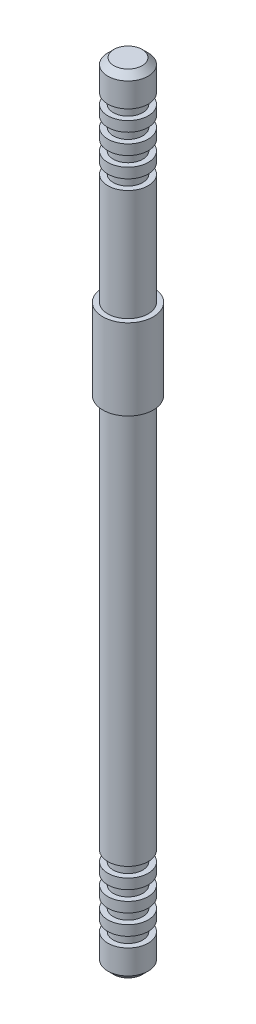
ISO-10303-21;
HEADER;
FILE_DESCRIPTION(('STEP AP214'),'2;1');
FILE_NAME('part.step','',(''),(''),'','','');
FILE_SCHEMA(('AUTOMOTIVE_DESIGN { 1 0 10303 214 1 1 1 1 }'));
ENDSEC;
DATA;
#1=APPLICATION_CONTEXT('core data for automotive mechanical design processes');
#2=APPLICATION_PROTOCOL_DEFINITION('international standard','automotive_design',2000,#1);
#3=PRODUCT_CONTEXT('',#1,'mechanical');
#4=PRODUCT('Part','Part','',(#3));
#5=PRODUCT_RELATED_PRODUCT_CATEGORY('part','',(#4));
#6=PRODUCT_DEFINITION_FORMATION('','',#4);
#7=PRODUCT_DEFINITION_CONTEXT('part definition',#1,'design');
#8=PRODUCT_DEFINITION('design','',#6,#7);
#9=PRODUCT_DEFINITION_SHAPE('','',#8);
#10=(LENGTH_UNIT() NAMED_UNIT(*) SI_UNIT(.MILLI.,.METRE.));
#11=(NAMED_UNIT(*) PLANE_ANGLE_UNIT() SI_UNIT($,.RADIAN.));
#12=(NAMED_UNIT(*) SI_UNIT($,.STERADIAN.) SOLID_ANGLE_UNIT());
#13=UNCERTAINTY_MEASURE_WITH_UNIT(LENGTH_MEASURE(1.E-05),#10,'distance_accuracy_value','');
#14=(GEOMETRIC_REPRESENTATION_CONTEXT(3) GLOBAL_UNCERTAINTY_ASSIGNED_CONTEXT((#13)) GLOBAL_UNIT_ASSIGNED_CONTEXT((#10,
#11,#12)) REPRESENTATION_CONTEXT('',''));
#15=CARTESIAN_POINT('',(0.,0.,0.));
#16=DIRECTION('',(0.,0.,1.));
#17=DIRECTION('',(1.,0.,0.));
#18=AXIS2_PLACEMENT_3D('',#15,#16,#17);
#19=CARTESIAN_POINT('',(-25.3725750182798,-54.7900027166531,0.));
#20=DIRECTION('',(0.,-1.,0.));
#21=DIRECTION('',(0.,0.,-1.));
#22=AXIS2_PLACEMENT_3D('',#19,#20,#21);
#23=PLANE('',#22);
#24=CARTESIAN_POINT('',(-25.3725750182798,-54.7900027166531,0.));
#25=DIRECTION('',(0.,-1.,0.));
#26=DIRECTION('',(0.,0.,-1.));
#27=AXIS2_PLACEMENT_3D('',#24,#25,#26);
#28=CIRCLE('',#27,0.700000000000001);
#29=CARTESIAN_POINT('',(-25.3725750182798,-54.7900027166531,-0.700000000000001));
#30=VERTEX_POINT('',#29);
#31=EDGE_CURVE('E10',#30,#30,#28,.F.);
#32=ORIENTED_EDGE('',*,*,#31,.T.);
#33=EDGE_LOOP('',(#32));
#34=FACE_BOUND('',#33,.T.);
#35=ADVANCED_FACE('F30',(#34),#23,.F.);
#36=CARTESIAN_POINT('',(-25.3725750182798,-54.7900027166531,0.));
#37=DIRECTION('',(0.,-1.,0.));
#38=DIRECTION('',(0.,0.,-1.));
#39=AXIS2_PLACEMENT_3D('',#36,#37,#38);
#40=CYLINDRICAL_SURFACE('',#39,1.);
#41=CARTESIAN_POINT('',(-25.3725750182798,-55.0900027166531,0.));
#42=DIRECTION('',(0.,-1.,0.));
#43=DIRECTION('',(0.,0.,-1.));
#44=AXIS2_PLACEMENT_3D('',#41,#42,#43);
#45=CIRCLE('',#44,1.);
#46=CARTESIAN_POINT('',(-25.3725750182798,-55.0900027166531,-1.));
#47=VERTEX_POINT('',#46);
#48=EDGE_CURVE('E36',#47,#47,#45,.T.);
#49=ORIENTED_EDGE('',*,*,#48,.T.);
#50=EDGE_LOOP('',(#49));
#51=FACE_BOUND('',#50,.T.);
#52=CARTESIAN_POINT('',(-25.3725750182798,-56.2900027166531,0.));
#53=DIRECTION('',(0.,-1.,0.));
#54=DIRECTION('',(0.,0.,-1.));
#55=AXIS2_PLACEMENT_3D('',#52,#53,#54);
#56=CIRCLE('',#55,1.);
#57=CARTESIAN_POINT('',(-25.3725750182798,-56.2900027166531,-1.));
#58=VERTEX_POINT('',#57);
#59=EDGE_CURVE('E49',#58,#58,#56,.T.);
#60=ORIENTED_EDGE('',*,*,#59,.F.);
#61=EDGE_LOOP('',(#60));
#62=FACE_BOUND('',#61,.T.);
#63=ADVANCED_FACE('F367',(#51,#62),#40,.T.);
#64=CARTESIAN_POINT('',(-26.3725750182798,-56.2900027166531,0.));
#65=DIRECTION('',(0.,1.,0.));
#66=DIRECTION('',(0.,0.,1.));
#67=AXIS2_PLACEMENT_3D('',#64,#65,#66);
#68=PLANE('',#67);
#69=CARTESIAN_POINT('',(-25.3725750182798,-56.2900027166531,0.));
#70=DIRECTION('',(0.,-1.,0.));
#71=DIRECTION('',(0.,0.,-1.));
#72=AXIS2_PLACEMENT_3D('',#69,#70,#71);
#73=CIRCLE('',#72,0.730000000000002);
#74=CARTESIAN_POINT('',(-25.3725750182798,-56.2900027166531,-0.730000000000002));
#75=VERTEX_POINT('',#74);
#76=EDGE_CURVE('E52',#75,#75,#73,.T.);
#77=ORIENTED_EDGE('',*,*,#76,.F.);
#78=EDGE_LOOP('',(#77));
#79=FACE_BOUND('',#78,.T.);
#80=ORIENTED_EDGE('',*,*,#59,.T.);
#81=EDGE_LOOP('',(#80));
#82=FACE_BOUND('',#81,.T.);
#83=ADVANCED_FACE('F361',(#79,#82),#68,.F.);
#84=CARTESIAN_POINT('',(-25.3725750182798,-54.7900027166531,0.));
#85=DIRECTION('',(0.,-1.,0.));
#86=DIRECTION('',(0.,0.,-1.));
#87=AXIS2_PLACEMENT_3D('',#84,#85,#86);
#88=CYLINDRICAL_SURFACE('',#87,0.730000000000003);
#89=CARTESIAN_POINT('',(-25.3725750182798,-56.7900027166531,0.));
#90=DIRECTION('',(0.,-1.,0.));
#91=DIRECTION('',(0.,0.,-1.));
#92=AXIS2_PLACEMENT_3D('',#89,#90,#91);
#93=CIRCLE('',#92,0.730000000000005);
#94=CARTESIAN_POINT('',(-25.3725750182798,-56.7900027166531,-0.730000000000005));
#95=VERTEX_POINT('',#94);
#96=EDGE_CURVE('E55',#95,#95,#93,.T.);
#97=ORIENTED_EDGE('',*,*,#96,.F.);
#98=EDGE_LOOP('',(#97));
#99=FACE_BOUND('',#98,.T.);
#100=ORIENTED_EDGE('',*,*,#76,.T.);
#101=EDGE_LOOP('',(#100));
#102=FACE_BOUND('',#101,.T.);
#103=ADVANCED_FACE('F355',(#99,#102),#88,.T.);
#104=CARTESIAN_POINT('',(-26.1025750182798,-56.7900027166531,0.));
#105=DIRECTION('',(0.,-1.,0.));
#106=DIRECTION('',(0.,0.,-1.));
#107=AXIS2_PLACEMENT_3D('',#104,#105,#106);
#108=PLANE('',#107);
#109=CARTESIAN_POINT('',(-25.3725750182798,-56.7900027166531,0.));
#110=DIRECTION('',(0.,-1.,0.));
#111=DIRECTION('',(0.,0.,-1.));
#112=AXIS2_PLACEMENT_3D('',#109,#110,#111);
#113=CIRCLE('',#112,1.);
#114=CARTESIAN_POINT('',(-25.3725750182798,-56.7900027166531,-1.));
#115=VERTEX_POINT('',#114);
#116=EDGE_CURVE('E58',#115,#115,#113,.T.);
#117=ORIENTED_EDGE('',*,*,#116,.F.);
#118=EDGE_LOOP('',(#117));
#119=FACE_BOUND('',#118,.T.);
#120=ORIENTED_EDGE('',*,*,#96,.T.);
#121=EDGE_LOOP('',(#120));
#122=FACE_BOUND('',#121,.T.);
#123=ADVANCED_FACE('F349',(#119,#122),#108,.F.);
#124=CARTESIAN_POINT('',(-25.3725750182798,-54.7900027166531,0.));
#125=DIRECTION('',(0.,-1.,0.));
#126=DIRECTION('',(0.,0.,-1.));
#127=AXIS2_PLACEMENT_3D('',#124,#125,#126);
#128=CYLINDRICAL_SURFACE('',#127,1.);
#129=CARTESIAN_POINT('',(-25.3725750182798,-57.2900027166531,0.));
#130=DIRECTION('',(0.,-1.,0.));
#131=DIRECTION('',(0.,0.,-1.));
#132=AXIS2_PLACEMENT_3D('',#129,#130,#131);
#133=CIRCLE('',#132,1.);
#134=CARTESIAN_POINT('',(-25.3725750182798,-57.2900027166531,-1.));
#135=VERTEX_POINT('',#134);
#136=EDGE_CURVE('E61',#135,#135,#133,.T.);
#137=ORIENTED_EDGE('',*,*,#136,.F.);
#138=EDGE_LOOP('',(#137));
#139=FACE_BOUND('',#138,.T.);
#140=ORIENTED_EDGE('',*,*,#116,.T.);
#141=EDGE_LOOP('',(#140));
#142=FACE_BOUND('',#141,.T.);
#143=ADVANCED_FACE('F343',(#139,#142),#128,.T.);
#144=CARTESIAN_POINT('',(-26.3725750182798,-57.2900027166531,0.));
#145=DIRECTION('',(0.,1.,0.));
#146=DIRECTION('',(0.,0.,1.));
#147=AXIS2_PLACEMENT_3D('',#144,#145,#146);
#148=PLANE('',#147);
#149=CARTESIAN_POINT('',(-25.3725750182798,-57.2900027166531,0.));
#150=DIRECTION('',(0.,-1.,0.));
#151=DIRECTION('',(0.,0.,-1.));
#152=AXIS2_PLACEMENT_3D('',#149,#150,#151);
#153=CIRCLE('',#152,0.730000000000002);
#154=CARTESIAN_POINT('',(-25.3725750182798,-57.2900027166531,-0.730000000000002));
#155=VERTEX_POINT('',#154);
#156=EDGE_CURVE('E64',#155,#155,#153,.T.);
#157=ORIENTED_EDGE('',*,*,#156,.F.);
#158=EDGE_LOOP('',(#157));
#159=FACE_BOUND('',#158,.T.);
#160=ORIENTED_EDGE('',*,*,#136,.T.);
#161=EDGE_LOOP('',(#160));
#162=FACE_BOUND('',#161,.T.);
#163=ADVANCED_FACE('F337',(#159,#162),#148,.F.);
#164=CARTESIAN_POINT('',(-25.3725750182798,-54.7900027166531,0.));
#165=DIRECTION('',(0.,-1.,0.));
#166=DIRECTION('',(0.,0.,-1.));
#167=AXIS2_PLACEMENT_3D('',#164,#165,#166);
#168=CYLINDRICAL_SURFACE('',#167,0.730000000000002);
#169=CARTESIAN_POINT('',(-25.3725750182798,-57.7900027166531,0.));
#170=DIRECTION('',(0.,-1.,0.));
#171=DIRECTION('',(0.,0.,-1.));
#172=AXIS2_PLACEMENT_3D('',#169,#170,#171);
#173=CIRCLE('',#172,0.730000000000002);
#174=CARTESIAN_POINT('',(-25.3725750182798,-57.7900027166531,-0.730000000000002));
#175=VERTEX_POINT('',#174);
#176=EDGE_CURVE('E67',#175,#175,#173,.T.);
#177=ORIENTED_EDGE('',*,*,#176,.F.);
#178=EDGE_LOOP('',(#177));
#179=FACE_BOUND('',#178,.T.);
#180=ORIENTED_EDGE('',*,*,#156,.T.);
#181=EDGE_LOOP('',(#180));
#182=FACE_BOUND('',#181,.T.);
#183=ADVANCED_FACE('F331',(#179,#182),#168,.T.);
#184=CARTESIAN_POINT('',(-26.1025750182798,-57.7900027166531,0.));
#185=DIRECTION('',(0.,-1.,0.));
#186=DIRECTION('',(0.,0.,-1.));
#187=AXIS2_PLACEMENT_3D('',#184,#185,#186);
#188=PLANE('',#187);
#189=CARTESIAN_POINT('',(-25.3725750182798,-57.7900027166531,0.));
#190=DIRECTION('',(0.,-1.,0.));
#191=DIRECTION('',(0.,0.,-1.));
#192=AXIS2_PLACEMENT_3D('',#189,#190,#191);
#193=CIRCLE('',#192,1.);
#194=CARTESIAN_POINT('',(-25.3725750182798,-57.7900027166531,-1.));
#195=VERTEX_POINT('',#194);
#196=EDGE_CURVE('E70',#195,#195,#193,.T.);
#197=ORIENTED_EDGE('',*,*,#196,.F.);
#198=EDGE_LOOP('',(#197));
#199=FACE_BOUND('',#198,.T.);
#200=ORIENTED_EDGE('',*,*,#176,.T.);
#201=EDGE_LOOP('',(#200));
#202=FACE_BOUND('',#201,.T.);
#203=ADVANCED_FACE('F325',(#199,#202),#188,.F.);
#204=CARTESIAN_POINT('',(-25.3725750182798,-54.7900027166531,0.));
#205=DIRECTION('',(0.,-1.,0.));
#206=DIRECTION('',(0.,0.,-1.));
#207=AXIS2_PLACEMENT_3D('',#204,#205,#206);
#208=CYLINDRICAL_SURFACE('',#207,1.);
#209=CARTESIAN_POINT('',(-25.3725750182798,-58.2900027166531,0.));
#210=DIRECTION('',(0.,-1.,0.));
#211=DIRECTION('',(0.,0.,-1.));
#212=AXIS2_PLACEMENT_3D('',#209,#210,#211);
#213=CIRCLE('',#212,1.);
#214=CARTESIAN_POINT('',(-25.3725750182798,-58.2900027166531,-1.));
#215=VERTEX_POINT('',#214);
#216=EDGE_CURVE('E73',#215,#215,#213,.T.);
#217=ORIENTED_EDGE('',*,*,#216,.F.);
#218=EDGE_LOOP('',(#217));
#219=FACE_BOUND('',#218,.T.);
#220=ORIENTED_EDGE('',*,*,#196,.T.);
#221=EDGE_LOOP('',(#220));
#222=FACE_BOUND('',#221,.T.);
#223=ADVANCED_FACE('F319',(#219,#222),#208,.T.);
#224=CARTESIAN_POINT('',(-26.3725750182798,-58.2900027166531,0.));
#225=DIRECTION('',(0.,1.,0.));
#226=DIRECTION('',(0.,0.,1.));
#227=AXIS2_PLACEMENT_3D('',#224,#225,#226);
#228=PLANE('',#227);
#229=CARTESIAN_POINT('',(-25.3725750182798,-58.2900027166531,0.));
#230=DIRECTION('',(0.,-1.,0.));
#231=DIRECTION('',(0.,0.,-1.));
#232=AXIS2_PLACEMENT_3D('',#229,#230,#231);
#233=CIRCLE('',#232,0.730000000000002);
#234=CARTESIAN_POINT('',(-25.3725750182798,-58.2900027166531,-0.730000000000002));
#235=VERTEX_POINT('',#234);
#236=EDGE_CURVE('E76',#235,#235,#233,.T.);
#237=ORIENTED_EDGE('',*,*,#236,.F.);
#238=EDGE_LOOP('',(#237));
#239=FACE_BOUND('',#238,.T.);
#240=ORIENTED_EDGE('',*,*,#216,.T.);
#241=EDGE_LOOP('',(#240));
#242=FACE_BOUND('',#241,.T.);
#243=ADVANCED_FACE('F313',(#239,#242),#228,.F.);
#244=CARTESIAN_POINT('',(-25.3725750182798,-54.7900027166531,0.));
#245=DIRECTION('',(0.,-1.,0.));
#246=DIRECTION('',(0.,0.,-1.));
#247=AXIS2_PLACEMENT_3D('',#244,#245,#246);
#248=CYLINDRICAL_SURFACE('',#247,0.730000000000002);
#249=CARTESIAN_POINT('',(-25.3725750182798,-58.7900027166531,0.));
#250=DIRECTION('',(0.,-1.,0.));
#251=DIRECTION('',(0.,0.,-1.));
#252=AXIS2_PLACEMENT_3D('',#249,#250,#251);
#253=CIRCLE('',#252,0.730000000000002);
#254=CARTESIAN_POINT('',(-25.3725750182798,-58.7900027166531,-0.730000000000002));
#255=VERTEX_POINT('',#254);
#256=EDGE_CURVE('E79',#255,#255,#253,.T.);
#257=ORIENTED_EDGE('',*,*,#256,.F.);
#258=EDGE_LOOP('',(#257));
#259=FACE_BOUND('',#258,.T.);
#260=ORIENTED_EDGE('',*,*,#236,.T.);
#261=EDGE_LOOP('',(#260));
#262=FACE_BOUND('',#261,.T.);
#263=ADVANCED_FACE('F307',(#259,#262),#248,.T.);
#264=CARTESIAN_POINT('',(-26.1025750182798,-58.7900027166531,0.));
#265=DIRECTION('',(0.,-1.,0.));
#266=DIRECTION('',(0.,0.,-1.));
#267=AXIS2_PLACEMENT_3D('',#264,#265,#266);
#268=PLANE('',#267);
#269=CARTESIAN_POINT('',(-25.3725750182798,-58.7900027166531,0.));
#270=DIRECTION('',(0.,-1.,0.));
#271=DIRECTION('',(0.,0.,-1.));
#272=AXIS2_PLACEMENT_3D('',#269,#270,#271);
#273=CIRCLE('',#272,1.);
#274=CARTESIAN_POINT('',(-25.3725750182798,-58.7900027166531,-1.));
#275=VERTEX_POINT('',#274);
#276=EDGE_CURVE('E82',#275,#275,#273,.T.);
#277=ORIENTED_EDGE('',*,*,#276,.F.);
#278=EDGE_LOOP('',(#277));
#279=FACE_BOUND('',#278,.T.);
#280=ORIENTED_EDGE('',*,*,#256,.T.);
#281=EDGE_LOOP('',(#280));
#282=FACE_BOUND('',#281,.T.);
#283=ADVANCED_FACE('F301',(#279,#282),#268,.F.);
#284=CARTESIAN_POINT('',(-25.3725750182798,-54.7900027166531,0.));
#285=DIRECTION('',(0.,-1.,0.));
#286=DIRECTION('',(0.,0.,-1.));
#287=AXIS2_PLACEMENT_3D('',#284,#285,#286);
#288=CYLINDRICAL_SURFACE('',#287,0.999999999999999);
#289=CARTESIAN_POINT('',(-25.3725750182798,-59.2900027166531,0.));
#290=DIRECTION('',(0.,-1.,0.));
#291=DIRECTION('',(0.,0.,-1.));
#292=AXIS2_PLACEMENT_3D('',#289,#290,#291);
#293=CIRCLE('',#292,0.999999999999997);
#294=CARTESIAN_POINT('',(-25.3725750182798,-59.2900027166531,-0.999999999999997));
#295=VERTEX_POINT('',#294);
#296=EDGE_CURVE('E85',#295,#295,#293,.T.);
#297=ORIENTED_EDGE('',*,*,#296,.F.);
#298=EDGE_LOOP('',(#297));
#299=FACE_BOUND('',#298,.T.);
#300=ORIENTED_EDGE('',*,*,#276,.T.);
#301=EDGE_LOOP('',(#300));
#302=FACE_BOUND('',#301,.T.);
#303=ADVANCED_FACE('F295',(#299,#302),#288,.T.);
#304=CARTESIAN_POINT('',(-26.3725750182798,-59.2900027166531,0.));
#305=DIRECTION('',(0.,1.,0.));
#306=DIRECTION('',(0.,0.,1.));
#307=AXIS2_PLACEMENT_3D('',#304,#305,#306);
#308=PLANE('',#307);
#309=CARTESIAN_POINT('',(-25.3725750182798,-59.2900027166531,0.));
#310=DIRECTION('',(0.,-1.,0.));
#311=DIRECTION('',(0.,0.,-1.));
#312=AXIS2_PLACEMENT_3D('',#309,#310,#311);
#313=CIRCLE('',#312,0.730000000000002);
#314=CARTESIAN_POINT('',(-25.3725750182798,-59.2900027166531,-0.730000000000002));
#315=VERTEX_POINT('',#314);
#316=EDGE_CURVE('E88',#315,#315,#313,.T.);
#317=ORIENTED_EDGE('',*,*,#316,.F.);
#318=EDGE_LOOP('',(#317));
#319=FACE_BOUND('',#318,.T.);
#320=ORIENTED_EDGE('',*,*,#296,.T.);
#321=EDGE_LOOP('',(#320));
#322=FACE_BOUND('',#321,.T.);
#323=ADVANCED_FACE('F289',(#319,#322),#308,.F.);
#324=CARTESIAN_POINT('',(-25.3725750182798,-54.7900027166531,0.));
#325=DIRECTION('',(0.,-1.,0.));
#326=DIRECTION('',(0.,0.,-1.));
#327=AXIS2_PLACEMENT_3D('',#324,#325,#326);
#328=CYLINDRICAL_SURFACE('',#327,0.730000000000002);
#329=CARTESIAN_POINT('',(-25.3725750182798,-59.7900027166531,0.));
#330=DIRECTION('',(0.,-1.,0.));
#331=DIRECTION('',(0.,0.,-1.));
#332=AXIS2_PLACEMENT_3D('',#329,#330,#331);
#333=CIRCLE('',#332,0.730000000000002);
#334=CARTESIAN_POINT('',(-25.3725750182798,-59.7900027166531,-0.730000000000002));
#335=VERTEX_POINT('',#334);
#336=EDGE_CURVE('E91',#335,#335,#333,.T.);
#337=ORIENTED_EDGE('',*,*,#336,.F.);
#338=EDGE_LOOP('',(#337));
#339=FACE_BOUND('',#338,.T.);
#340=ORIENTED_EDGE('',*,*,#316,.T.);
#341=EDGE_LOOP('',(#340));
#342=FACE_BOUND('',#341,.T.);
#343=ADVANCED_FACE('F283',(#339,#342),#328,.T.);
#344=CARTESIAN_POINT('',(-26.1025750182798,-59.7900027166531,0.));
#345=DIRECTION('',(0.,-1.,0.));
#346=DIRECTION('',(0.,0.,-1.));
#347=AXIS2_PLACEMENT_3D('',#344,#345,#346);
#348=PLANE('',#347);
#349=CARTESIAN_POINT('',(-25.3725750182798,-59.7900027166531,0.));
#350=DIRECTION('',(0.,-1.,0.));
#351=DIRECTION('',(0.,0.,-1.));
#352=AXIS2_PLACEMENT_3D('',#349,#350,#351);
#353=CIRCLE('',#352,1.);
#354=CARTESIAN_POINT('',(-25.3725750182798,-59.7900027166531,-1.));
#355=VERTEX_POINT('',#354);
#356=EDGE_CURVE('E94',#355,#355,#353,.T.);
#357=ORIENTED_EDGE('',*,*,#356,.F.);
#358=EDGE_LOOP('',(#357));
#359=FACE_BOUND('',#358,.T.);
#360=ORIENTED_EDGE('',*,*,#336,.T.);
#361=EDGE_LOOP('',(#360));
#362=FACE_BOUND('',#361,.T.);
#363=ADVANCED_FACE('F277',(#359,#362),#348,.F.);
#364=CARTESIAN_POINT('',(-25.3725750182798,-54.7900027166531,0.));
#365=DIRECTION('',(0.,-1.,0.));
#366=DIRECTION('',(0.,0.,-1.));
#367=AXIS2_PLACEMENT_3D('',#364,#365,#366);
#368=CYLINDRICAL_SURFACE('',#367,1.);
#369=CARTESIAN_POINT('',(-25.3725750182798,-65.2900027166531,0.));
#370=DIRECTION('',(0.,-1.,0.));
#371=DIRECTION('',(0.,0.,-1.));
#372=AXIS2_PLACEMENT_3D('',#369,#370,#371);
#373=CIRCLE('',#372,1.);
#374=CARTESIAN_POINT('',(-25.3725750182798,-65.2900027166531,-1.));
#375=VERTEX_POINT('',#374);
#376=EDGE_CURVE('E97',#375,#375,#373,.T.);
#377=ORIENTED_EDGE('',*,*,#376,.F.);
#378=EDGE_LOOP('',(#377));
#379=FACE_BOUND('',#378,.T.);
#380=ORIENTED_EDGE('',*,*,#356,.T.);
#381=EDGE_LOOP('',(#380));
#382=FACE_BOUND('',#381,.T.);
#383=ADVANCED_FACE('F271',(#379,#382),#368,.T.);
#384=CARTESIAN_POINT('',(-26.6225750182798,-65.2900027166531,0.));
#385=DIRECTION('',(0.,-1.,0.));
#386=DIRECTION('',(0.,0.,-1.));
#387=AXIS2_PLACEMENT_3D('',#384,#385,#386);
#388=PLANE('',#387);
#389=CARTESIAN_POINT('',(-25.3725750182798,-65.2900027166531,0.));
#390=DIRECTION('',(0.,-1.,0.));
#391=DIRECTION('',(0.,0.,-1.));
#392=AXIS2_PLACEMENT_3D('',#389,#390,#391);
#393=CIRCLE('',#392,1.25);
#394=CARTESIAN_POINT('',(-25.3725750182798,-65.2900027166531,-1.25));
#395=VERTEX_POINT('',#394);
#396=EDGE_CURVE('E100',#395,#395,#393,.T.);
#397=ORIENTED_EDGE('',*,*,#396,.F.);
#398=EDGE_LOOP('',(#397));
#399=FACE_BOUND('',#398,.T.);
#400=ORIENTED_EDGE('',*,*,#376,.T.);
#401=EDGE_LOOP('',(#400));
#402=FACE_BOUND('',#401,.T.);
#403=ADVANCED_FACE('F265',(#399,#402),#388,.F.);
#404=CARTESIAN_POINT('',(-25.3725750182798,-54.7900027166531,0.));
#405=DIRECTION('',(0.,-1.,0.));
#406=DIRECTION('',(0.,0.,-1.));
#407=AXIS2_PLACEMENT_3D('',#404,#405,#406);
#408=CYLINDRICAL_SURFACE('',#407,1.25);
#409=CARTESIAN_POINT('',(-25.3725750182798,-69.2900027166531,0.));
#410=DIRECTION('',(0.,-1.,0.));
#411=DIRECTION('',(0.,0.,-1.));
#412=AXIS2_PLACEMENT_3D('',#409,#410,#411);
#413=CIRCLE('',#412,1.25);
#414=CARTESIAN_POINT('',(-25.3725750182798,-69.2900027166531,-1.25));
#415=VERTEX_POINT('',#414);
#416=EDGE_CURVE('E103',#415,#415,#413,.T.);
#417=ORIENTED_EDGE('',*,*,#416,.F.);
#418=EDGE_LOOP('',(#417));
#419=FACE_BOUND('',#418,.T.);
#420=ORIENTED_EDGE('',*,*,#396,.T.);
#421=EDGE_LOOP('',(#420));
#422=FACE_BOUND('',#421,.T.);
#423=ADVANCED_FACE('F259',(#419,#422),#408,.T.);
#424=CARTESIAN_POINT('',(-26.3725750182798,-69.2900027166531,0.));
#425=DIRECTION('',(0.,1.,0.));
#426=DIRECTION('',(0.,0.,1.));
#427=AXIS2_PLACEMENT_3D('',#424,#425,#426);
#428=PLANE('',#427);
#429=CARTESIAN_POINT('',(-25.3725750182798,-69.2900027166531,0.));
#430=DIRECTION('',(0.,-1.,0.));
#431=DIRECTION('',(0.,0.,-1.));
#432=AXIS2_PLACEMENT_3D('',#429,#430,#431);
#433=CIRCLE('',#432,0.999999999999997);
#434=CARTESIAN_POINT('',(-25.3725750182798,-69.2900027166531,-0.999999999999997));
#435=VERTEX_POINT('',#434);
#436=EDGE_CURVE('E106',#435,#435,#433,.T.);
#437=ORIENTED_EDGE('',*,*,#436,.F.);
#438=EDGE_LOOP('',(#437));
#439=FACE_BOUND('',#438,.T.);
#440=ORIENTED_EDGE('',*,*,#416,.T.);
#441=EDGE_LOOP('',(#440));
#442=FACE_BOUND('',#441,.T.);
#443=ADVANCED_FACE('F253',(#439,#442),#428,.F.);
#444=CARTESIAN_POINT('',(-25.3725750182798,-54.7900027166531,0.));
#445=DIRECTION('',(0.,-1.,0.));
#446=DIRECTION('',(0.,0.,-1.));
#447=AXIS2_PLACEMENT_3D('',#444,#445,#446);
#448=CYLINDRICAL_SURFACE('',#447,0.999999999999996);
#449=CARTESIAN_POINT('',(-25.3725750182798,-88.7900027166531,0.));
#450=DIRECTION('',(0.,-1.,0.));
#451=DIRECTION('',(0.,0.,-1.));
#452=AXIS2_PLACEMENT_3D('',#449,#450,#451);
#453=CIRCLE('',#452,0.999999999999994);
#454=CARTESIAN_POINT('',(-25.3725750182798,-88.7900027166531,-0.999999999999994));
#455=VERTEX_POINT('',#454);
#456=EDGE_CURVE('E109',#455,#455,#453,.T.);
#457=ORIENTED_EDGE('',*,*,#456,.F.);
#458=EDGE_LOOP('',(#457));
#459=FACE_BOUND('',#458,.T.);
#460=ORIENTED_EDGE('',*,*,#436,.T.);
#461=EDGE_LOOP('',(#460));
#462=FACE_BOUND('',#461,.T.);
#463=ADVANCED_FACE('F247',(#459,#462),#448,.T.);
#464=CARTESIAN_POINT('',(-26.3725750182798,-88.7900027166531,0.));
#465=DIRECTION('',(0.,1.,0.));
#466=DIRECTION('',(0.,0.,1.));
#467=AXIS2_PLACEMENT_3D('',#464,#465,#466);
#468=PLANE('',#467);
#469=CARTESIAN_POINT('',(-25.3725750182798,-88.7900027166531,0.));
#470=DIRECTION('',(0.,-1.,0.));
#471=DIRECTION('',(0.,0.,-1.));
#472=AXIS2_PLACEMENT_3D('',#469,#470,#471);
#473=CIRCLE('',#472,0.729999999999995);
#474=CARTESIAN_POINT('',(-25.3725750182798,-88.7900027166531,-0.729999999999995));
#475=VERTEX_POINT('',#474);
#476=EDGE_CURVE('E112',#475,#475,#473,.T.);
#477=ORIENTED_EDGE('',*,*,#476,.F.);
#478=EDGE_LOOP('',(#477));
#479=FACE_BOUND('',#478,.T.);
#480=ORIENTED_EDGE('',*,*,#456,.T.);
#481=EDGE_LOOP('',(#480));
#482=FACE_BOUND('',#481,.T.);
#483=ADVANCED_FACE('F241',(#479,#482),#468,.F.);
#484=CARTESIAN_POINT('',(-25.3725750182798,-54.7900027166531,0.));
#485=DIRECTION('',(0.,-1.,0.));
#486=DIRECTION('',(0.,0.,-1.));
#487=AXIS2_PLACEMENT_3D('',#484,#485,#486);
#488=CYLINDRICAL_SURFACE('',#487,0.729999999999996);
#489=CARTESIAN_POINT('',(-25.3725750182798,-89.2900027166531,0.));
#490=DIRECTION('',(0.,-1.,0.));
#491=DIRECTION('',(0.,0.,-1.));
#492=AXIS2_PLACEMENT_3D('',#489,#490,#491);
#493=CIRCLE('',#492,0.729999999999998);
#494=CARTESIAN_POINT('',(-25.3725750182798,-89.2900027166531,-0.729999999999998));
#495=VERTEX_POINT('',#494);
#496=EDGE_CURVE('E115',#495,#495,#493,.T.);
#497=ORIENTED_EDGE('',*,*,#496,.F.);
#498=EDGE_LOOP('',(#497));
#499=FACE_BOUND('',#498,.T.);
#500=ORIENTED_EDGE('',*,*,#476,.T.);
#501=EDGE_LOOP('',(#500));
#502=FACE_BOUND('',#501,.T.);
#503=ADVANCED_FACE('F235',(#499,#502),#488,.T.);
#504=CARTESIAN_POINT('',(-26.1025750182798,-89.2900027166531,0.));
#505=DIRECTION('',(0.,-1.,0.));
#506=DIRECTION('',(0.,0.,-1.));
#507=AXIS2_PLACEMENT_3D('',#504,#505,#506);
#508=PLANE('',#507);
#509=CARTESIAN_POINT('',(-25.3725750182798,-89.2900027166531,0.));
#510=DIRECTION('',(0.,-1.,0.));
#511=DIRECTION('',(0.,0.,-1.));
#512=AXIS2_PLACEMENT_3D('',#509,#510,#511);
#513=CIRCLE('',#512,0.999999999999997);
#514=CARTESIAN_POINT('',(-25.3725750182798,-89.2900027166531,-0.999999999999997));
#515=VERTEX_POINT('',#514);
#516=EDGE_CURVE('E118',#515,#515,#513,.T.);
#517=ORIENTED_EDGE('',*,*,#516,.F.);
#518=EDGE_LOOP('',(#517));
#519=FACE_BOUND('',#518,.T.);
#520=ORIENTED_EDGE('',*,*,#496,.T.);
#521=EDGE_LOOP('',(#520));
#522=FACE_BOUND('',#521,.T.);
#523=ADVANCED_FACE('F229',(#519,#522),#508,.F.);
#524=CARTESIAN_POINT('',(-25.3725750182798,-54.7900027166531,0.));
#525=DIRECTION('',(0.,-1.,0.));
#526=DIRECTION('',(0.,0.,-1.));
#527=AXIS2_PLACEMENT_3D('',#524,#525,#526);
#528=CYLINDRICAL_SURFACE('',#527,0.999999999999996);
#529=CARTESIAN_POINT('',(-25.3725750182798,-89.7900027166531,0.));
#530=DIRECTION('',(0.,-1.,0.));
#531=DIRECTION('',(0.,0.,-1.));
#532=AXIS2_PLACEMENT_3D('',#529,#530,#531);
#533=CIRCLE('',#532,0.999999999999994);
#534=CARTESIAN_POINT('',(-25.3725750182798,-89.7900027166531,-0.999999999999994));
#535=VERTEX_POINT('',#534);
#536=EDGE_CURVE('E121',#535,#535,#533,.T.);
#537=ORIENTED_EDGE('',*,*,#536,.F.);
#538=EDGE_LOOP('',(#537));
#539=FACE_BOUND('',#538,.T.);
#540=ORIENTED_EDGE('',*,*,#516,.T.);
#541=EDGE_LOOP('',(#540));
#542=FACE_BOUND('',#541,.T.);
#543=ADVANCED_FACE('F223',(#539,#542),#528,.T.);
#544=CARTESIAN_POINT('',(-26.3725750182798,-89.7900027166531,0.));
#545=DIRECTION('',(0.,1.,0.));
#546=DIRECTION('',(0.,0.,1.));
#547=AXIS2_PLACEMENT_3D('',#544,#545,#546);
#548=PLANE('',#547);
#549=CARTESIAN_POINT('',(-25.3725750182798,-89.7900027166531,0.));
#550=DIRECTION('',(0.,-1.,0.));
#551=DIRECTION('',(0.,0.,-1.));
#552=AXIS2_PLACEMENT_3D('',#549,#550,#551);
#553=CIRCLE('',#552,0.729999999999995);
#554=CARTESIAN_POINT('',(-25.3725750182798,-89.7900027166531,-0.729999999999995));
#555=VERTEX_POINT('',#554);
#556=EDGE_CURVE('E124',#555,#555,#553,.T.);
#557=ORIENTED_EDGE('',*,*,#556,.F.);
#558=EDGE_LOOP('',(#557));
#559=FACE_BOUND('',#558,.T.);
#560=ORIENTED_EDGE('',*,*,#536,.T.);
#561=EDGE_LOOP('',(#560));
#562=FACE_BOUND('',#561,.T.);
#563=ADVANCED_FACE('F217',(#559,#562),#548,.F.);
#564=CARTESIAN_POINT('',(-25.3725750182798,-54.7900027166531,0.));
#565=DIRECTION('',(0.,-1.,0.));
#566=DIRECTION('',(0.,0.,-1.));
#567=AXIS2_PLACEMENT_3D('',#564,#565,#566);
#568=CYLINDRICAL_SURFACE('',#567,0.729999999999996);
#569=CARTESIAN_POINT('',(-25.3725750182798,-90.2900027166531,0.));
#570=DIRECTION('',(0.,-1.,0.));
#571=DIRECTION('',(0.,0.,-1.));
#572=AXIS2_PLACEMENT_3D('',#569,#570,#571);
#573=CIRCLE('',#572,0.729999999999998);
#574=CARTESIAN_POINT('',(-25.3725750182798,-90.2900027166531,-0.729999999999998));
#575=VERTEX_POINT('',#574);
#576=EDGE_CURVE('E127',#575,#575,#573,.T.);
#577=ORIENTED_EDGE('',*,*,#576,.F.);
#578=EDGE_LOOP('',(#577));
#579=FACE_BOUND('',#578,.T.);
#580=ORIENTED_EDGE('',*,*,#556,.T.);
#581=EDGE_LOOP('',(#580));
#582=FACE_BOUND('',#581,.T.);
#583=ADVANCED_FACE('F211',(#579,#582),#568,.T.);
#584=CARTESIAN_POINT('',(-26.1025750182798,-90.2900027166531,0.));
#585=DIRECTION('',(0.,-1.,0.));
#586=DIRECTION('',(0.,0.,-1.));
#587=AXIS2_PLACEMENT_3D('',#584,#585,#586);
#588=PLANE('',#587);
#589=CARTESIAN_POINT('',(-25.3725750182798,-90.2900027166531,0.));
#590=DIRECTION('',(0.,-1.,0.));
#591=DIRECTION('',(0.,0.,-1.));
#592=AXIS2_PLACEMENT_3D('',#589,#590,#591);
#593=CIRCLE('',#592,0.999999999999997);
#594=CARTESIAN_POINT('',(-25.3725750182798,-90.2900027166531,-0.999999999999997));
#595=VERTEX_POINT('',#594);
#596=EDGE_CURVE('E130',#595,#595,#593,.T.);
#597=ORIENTED_EDGE('',*,*,#596,.F.);
#598=EDGE_LOOP('',(#597));
#599=FACE_BOUND('',#598,.T.);
#600=ORIENTED_EDGE('',*,*,#576,.T.);
#601=EDGE_LOOP('',(#600));
#602=FACE_BOUND('',#601,.T.);
#603=ADVANCED_FACE('F205',(#599,#602),#588,.F.);
#604=CARTESIAN_POINT('',(-25.3725750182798,-54.7900027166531,0.));
#605=DIRECTION('',(0.,-1.,0.));
#606=DIRECTION('',(0.,0.,-1.));
#607=AXIS2_PLACEMENT_3D('',#604,#605,#606);
#608=CYLINDRICAL_SURFACE('',#607,0.999999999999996);
#609=CARTESIAN_POINT('',(-25.3725750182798,-90.7900027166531,0.));
#610=DIRECTION('',(0.,-1.,0.));
#611=DIRECTION('',(0.,0.,-1.));
#612=AXIS2_PLACEMENT_3D('',#609,#610,#611);
#613=CIRCLE('',#612,0.999999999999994);
#614=CARTESIAN_POINT('',(-25.3725750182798,-90.7900027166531,-0.999999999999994));
#615=VERTEX_POINT('',#614);
#616=EDGE_CURVE('E133',#615,#615,#613,.T.);
#617=ORIENTED_EDGE('',*,*,#616,.F.);
#618=EDGE_LOOP('',(#617));
#619=FACE_BOUND('',#618,.T.);
#620=ORIENTED_EDGE('',*,*,#596,.T.);
#621=EDGE_LOOP('',(#620));
#622=FACE_BOUND('',#621,.T.);
#623=ADVANCED_FACE('F199',(#619,#622),#608,.T.);
#624=CARTESIAN_POINT('',(-26.3725750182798,-90.7900027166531,0.));
#625=DIRECTION('',(0.,1.,0.));
#626=DIRECTION('',(0.,0.,1.));
#627=AXIS2_PLACEMENT_3D('',#624,#625,#626);
#628=PLANE('',#627);
#629=CARTESIAN_POINT('',(-25.3725750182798,-90.7900027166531,0.));
#630=DIRECTION('',(0.,-1.,0.));
#631=DIRECTION('',(0.,0.,-1.));
#632=AXIS2_PLACEMENT_3D('',#629,#630,#631);
#633=CIRCLE('',#632,0.729999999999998);
#634=CARTESIAN_POINT('',(-25.3725750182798,-90.7900027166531,-0.729999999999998));
#635=VERTEX_POINT('',#634);
#636=EDGE_CURVE('E136',#635,#635,#633,.T.);
#637=ORIENTED_EDGE('',*,*,#636,.F.);
#638=EDGE_LOOP('',(#637));
#639=FACE_BOUND('',#638,.T.);
#640=ORIENTED_EDGE('',*,*,#616,.T.);
#641=EDGE_LOOP('',(#640));
#642=FACE_BOUND('',#641,.T.);
#643=ADVANCED_FACE('F193',(#639,#642),#628,.F.);
#644=CARTESIAN_POINT('',(-25.3725750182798,-54.7900027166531,0.));
#645=DIRECTION('',(0.,-1.,0.));
#646=DIRECTION('',(0.,0.,-1.));
#647=AXIS2_PLACEMENT_3D('',#644,#645,#646);
#648=CYLINDRICAL_SURFACE('',#647,0.729999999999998);
#649=CARTESIAN_POINT('',(-25.3725750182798,-91.2900027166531,0.));
#650=DIRECTION('',(0.,-1.,0.));
#651=DIRECTION('',(0.,0.,-1.));
#652=AXIS2_PLACEMENT_3D('',#649,#650,#651);
#653=CIRCLE('',#652,0.729999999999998);
#654=CARTESIAN_POINT('',(-25.3725750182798,-91.2900027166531,-0.729999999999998));
#655=VERTEX_POINT('',#654);
#656=EDGE_CURVE('E139',#655,#655,#653,.T.);
#657=ORIENTED_EDGE('',*,*,#656,.F.);
#658=EDGE_LOOP('',(#657));
#659=FACE_BOUND('',#658,.T.);
#660=ORIENTED_EDGE('',*,*,#636,.T.);
#661=EDGE_LOOP('',(#660));
#662=FACE_BOUND('',#661,.T.);
#663=ADVANCED_FACE('F187',(#659,#662),#648,.T.);
#664=CARTESIAN_POINT('',(-26.1025750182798,-91.2900027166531,0.));
#665=DIRECTION('',(0.,-1.,0.));
#666=DIRECTION('',(0.,0.,-1.));
#667=AXIS2_PLACEMENT_3D('',#664,#665,#666);
#668=PLANE('',#667);
#669=CARTESIAN_POINT('',(-25.3725750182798,-91.2900027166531,0.));
#670=DIRECTION('',(0.,-1.,0.));
#671=DIRECTION('',(0.,0.,-1.));
#672=AXIS2_PLACEMENT_3D('',#669,#670,#671);
#673=CIRCLE('',#672,0.999999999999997);
#674=CARTESIAN_POINT('',(-25.3725750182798,-91.2900027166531,-0.999999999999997));
#675=VERTEX_POINT('',#674);
#676=EDGE_CURVE('E142',#675,#675,#673,.T.);
#677=ORIENTED_EDGE('',*,*,#676,.F.);
#678=EDGE_LOOP('',(#677));
#679=FACE_BOUND('',#678,.T.);
#680=ORIENTED_EDGE('',*,*,#656,.T.);
#681=EDGE_LOOP('',(#680));
#682=FACE_BOUND('',#681,.T.);
#683=ADVANCED_FACE('F181',(#679,#682),#668,.F.);
#684=CARTESIAN_POINT('',(-25.3725750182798,-54.7900027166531,0.));
#685=DIRECTION('',(0.,-1.,0.));
#686=DIRECTION('',(0.,0.,-1.));
#687=AXIS2_PLACEMENT_3D('',#684,#685,#686);
#688=CYLINDRICAL_SURFACE('',#687,0.999999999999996);
#689=CARTESIAN_POINT('',(-25.3725750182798,-91.7900027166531,0.));
#690=DIRECTION('',(0.,-1.,0.));
#691=DIRECTION('',(0.,0.,-1.));
#692=AXIS2_PLACEMENT_3D('',#689,#690,#691);
#693=CIRCLE('',#692,0.999999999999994);
#694=CARTESIAN_POINT('',(-25.3725750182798,-91.7900027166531,-0.999999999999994));
#695=VERTEX_POINT('',#694);
#696=EDGE_CURVE('E145',#695,#695,#693,.T.);
#697=ORIENTED_EDGE('',*,*,#696,.F.);
#698=EDGE_LOOP('',(#697));
#699=FACE_BOUND('',#698,.T.);
#700=ORIENTED_EDGE('',*,*,#676,.T.);
#701=EDGE_LOOP('',(#700));
#702=FACE_BOUND('',#701,.T.);
#703=ADVANCED_FACE('F175',(#699,#702),#688,.T.);
#704=CARTESIAN_POINT('',(-26.1025750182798,-91.7900027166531,0.));
#705=DIRECTION('',(0.,1.,0.));
#706=DIRECTION('',(0.,0.,1.));
#707=AXIS2_PLACEMENT_3D('',#704,#705,#706);
#708=PLANE('',#707);
#709=CARTESIAN_POINT('',(-25.3725750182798,-91.7900027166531,0.));
#710=DIRECTION('',(0.,-1.,0.));
#711=DIRECTION('',(0.,0.,-1.));
#712=AXIS2_PLACEMENT_3D('',#709,#710,#711);
#713=CIRCLE('',#712,0.729999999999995);
#714=CARTESIAN_POINT('',(-25.3725750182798,-91.7900027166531,-0.729999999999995));
#715=VERTEX_POINT('',#714);
#716=EDGE_CURVE('E148',#715,#715,#713,.T.);
#717=ORIENTED_EDGE('',*,*,#716,.F.);
#718=EDGE_LOOP('',(#717));
#719=FACE_BOUND('',#718,.T.);
#720=ORIENTED_EDGE('',*,*,#696,.T.);
#721=EDGE_LOOP('',(#720));
#722=FACE_BOUND('',#721,.T.);
#723=ADVANCED_FACE('F169',(#719,#722),#708,.F.);
#724=CARTESIAN_POINT('',(-25.3725750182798,-54.7900027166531,0.));
#725=DIRECTION('',(0.,-1.,0.));
#726=DIRECTION('',(0.,0.,-1.));
#727=AXIS2_PLACEMENT_3D('',#724,#725,#726);
#728=CYLINDRICAL_SURFACE('',#727,0.729999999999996);
#729=CARTESIAN_POINT('',(-25.3725750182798,-92.2900027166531,0.));
#730=DIRECTION('',(0.,-1.,0.));
#731=DIRECTION('',(0.,0.,-1.));
#732=AXIS2_PLACEMENT_3D('',#729,#730,#731);
#733=CIRCLE('',#732,0.729999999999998);
#734=CARTESIAN_POINT('',(-25.3725750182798,-92.2900027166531,-0.729999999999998));
#735=VERTEX_POINT('',#734);
#736=EDGE_CURVE('E151',#735,#735,#733,.T.);
#737=ORIENTED_EDGE('',*,*,#736,.F.);
#738=EDGE_LOOP('',(#737));
#739=FACE_BOUND('',#738,.T.);
#740=ORIENTED_EDGE('',*,*,#716,.T.);
#741=EDGE_LOOP('',(#740));
#742=FACE_BOUND('',#741,.T.);
#743=ADVANCED_FACE('F163',(#739,#742),#728,.T.);
#744=CARTESIAN_POINT('',(-26.1025750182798,-92.2900027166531,0.));
#745=DIRECTION('',(0.,-1.,0.));
#746=DIRECTION('',(0.,0.,-1.));
#747=AXIS2_PLACEMENT_3D('',#744,#745,#746);
#748=PLANE('',#747);
#749=CARTESIAN_POINT('',(-25.3725750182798,-92.2900027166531,0.));
#750=DIRECTION('',(0.,-1.,0.));
#751=DIRECTION('',(0.,0.,-1.));
#752=AXIS2_PLACEMENT_3D('',#749,#750,#751);
#753=CIRCLE('',#752,0.999999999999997);
#754=CARTESIAN_POINT('',(-25.3725750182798,-92.2900027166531,-0.999999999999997));
#755=VERTEX_POINT('',#754);
#756=EDGE_CURVE('E154',#755,#755,#753,.T.);
#757=ORIENTED_EDGE('',*,*,#756,.F.);
#758=EDGE_LOOP('',(#757));
#759=FACE_BOUND('',#758,.T.);
#760=ORIENTED_EDGE('',*,*,#736,.T.);
#761=EDGE_LOOP('',(#760));
#762=FACE_BOUND('',#761,.T.);
#763=ADVANCED_FACE('F160',(#759,#762),#748,.F.);
#764=CARTESIAN_POINT('',(-25.3725750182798,-54.7900027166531,0.));
#765=DIRECTION('',(0.,-1.,0.));
#766=DIRECTION('',(0.,0.,-1.));
#767=AXIS2_PLACEMENT_3D('',#764,#765,#766);
#768=CYLINDRICAL_SURFACE('',#767,0.999999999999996);
#769=CARTESIAN_POINT('',(-25.3725750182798,-93.4900027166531,0.));
#770=DIRECTION('',(0.,1.,0.));
#771=DIRECTION('',(0.,0.,1.));
#772=AXIS2_PLACEMENT_3D('',#769,#770,#771);
#773=CIRCLE('',#772,0.999999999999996);
#774=CARTESIAN_POINT('',(-25.3725750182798,-93.4900027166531,0.999999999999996));
#775=VERTEX_POINT('',#774);
#776=EDGE_CURVE('E40',#775,#775,#773,.T.);
#777=ORIENTED_EDGE('',*,*,#776,.T.);
#778=EDGE_LOOP('',(#777));
#779=FACE_BOUND('',#778,.T.);
#780=ORIENTED_EDGE('',*,*,#756,.T.);
#781=EDGE_LOOP('',(#780));
#782=FACE_BOUND('',#781,.T.);
#783=ADVANCED_FACE('F158',(#779,#782),#768,.T.);
#784=CARTESIAN_POINT('',(-26.3725750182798,-93.7900027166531,0.));
#785=DIRECTION('',(0.,1.,0.));
#786=DIRECTION('',(0.,0.,1.));
#787=AXIS2_PLACEMENT_3D('',#784,#785,#786);
#788=PLANE('',#787);
#789=CARTESIAN_POINT('',(-25.3725750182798,-93.7900027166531,0.));
#790=DIRECTION('',(0.,1.,0.));
#791=DIRECTION('',(0.,0.,1.));
#792=AXIS2_PLACEMENT_3D('',#789,#790,#791);
#793=CIRCLE('',#792,0.7);
#794=CARTESIAN_POINT('',(-25.3725750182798,-93.7900027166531,0.7));
#795=VERTEX_POINT('',#794);
#796=EDGE_CURVE('E44',#795,#795,#793,.F.);
#797=ORIENTED_EDGE('',*,*,#796,.T.);
#798=EDGE_LOOP('',(#797));
#799=FACE_BOUND('',#798,.T.);
#800=ADVANCED_FACE('F378',(#799),#788,.F.);
#801=CARTESIAN_POINT('',(-25.3725750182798,-93.7900027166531,0.));
#802=DIRECTION('',(0.,1.,0.));
#803=DIRECTION('',(0.,0.,1.));
#804=AXIS2_PLACEMENT_3D('',#801,#802,#803);
#805=CONICAL_SURFACE('',#804,0.7,0.78539816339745);
#806=ORIENTED_EDGE('',*,*,#776,.F.);
#807=EDGE_LOOP('',(#806));
#808=FACE_BOUND('',#807,.T.);
#809=ORIENTED_EDGE('',*,*,#796,.F.);
#810=EDGE_LOOP('',(#809));
#811=FACE_BOUND('',#810,.T.);
#812=ADVANCED_FACE('F382',(#808,#811),#805,.T.);
#813=CARTESIAN_POINT('',(-25.3725750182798,-55.0900027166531,0.));
#814=DIRECTION('',(0.,-1.,0.));
#815=DIRECTION('',(0.,0.,-1.));
#816=AXIS2_PLACEMENT_3D('',#813,#814,#815);
#817=CONICAL_SURFACE('',#816,1.,0.785398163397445);
#818=ORIENTED_EDGE('',*,*,#31,.F.);
#819=EDGE_LOOP('',(#818));
#820=FACE_BOUND('',#819,.T.);
#821=ORIENTED_EDGE('',*,*,#48,.F.);
#822=EDGE_LOOP('',(#821));
#823=FACE_BOUND('',#822,.T.);
#824=ADVANCED_FACE('F386',(#820,#823),#817,.T.);
#825=CLOSED_SHELL('',(#35,#63,#83,#103,#123,#143,#163,#183,#203,#223,#243,#263,#283,#303,#323,
#343,#363,#383,#403,#423,#443,#463,#483,#503,#523,#543,#563,#583,#603,#623,#643,#663,#683,#703,
#723,#743,#763,#783,#800,#812,#824));
#826=MANIFOLD_SOLID_BREP('B2',#825);
#827=ADVANCED_BREP_SHAPE_REPRESENTATION('',(#18,#826),#14);
#828=SHAPE_DEFINITION_REPRESENTATION(#9,#827);
ENDSEC;
END-ISO-10303-21;
